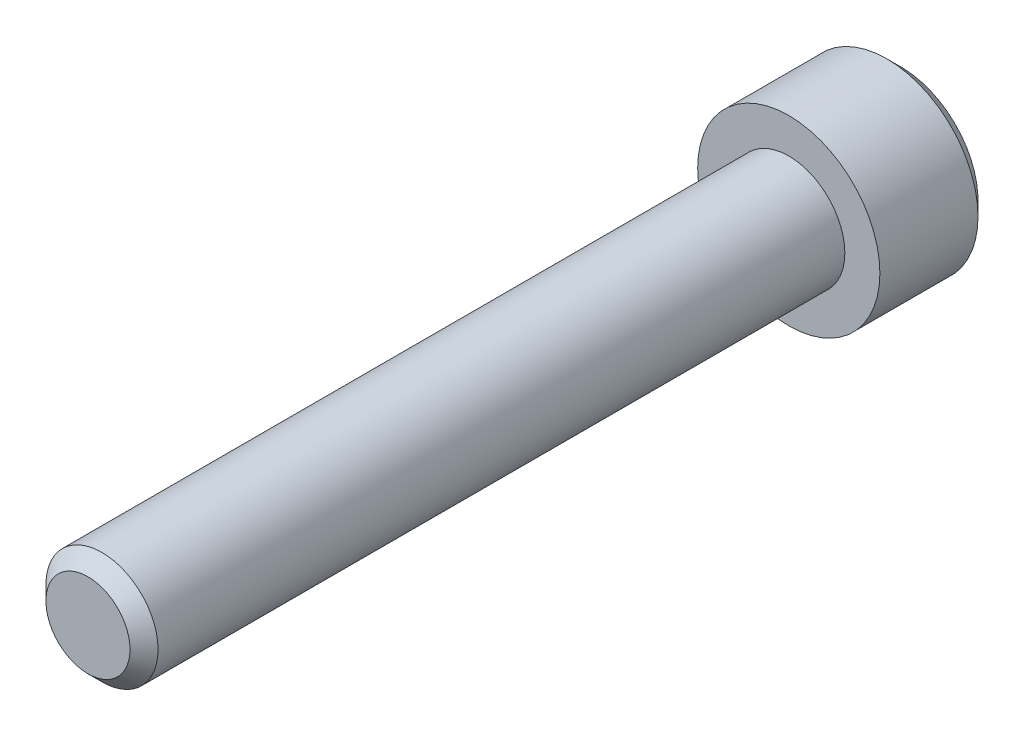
ISO-10303-21;
HEADER;
FILE_DESCRIPTION(('STEP AP214'),'2;1');
FILE_NAME('part.step','',(''),(''),'','','');
FILE_SCHEMA(('AUTOMOTIVE_DESIGN { 1 0 10303 214 1 1 1 1 }'));
ENDSEC;
DATA;
#1=APPLICATION_CONTEXT('core data for automotive mechanical design processes');
#2=APPLICATION_PROTOCOL_DEFINITION('international standard','automotive_design',2000,#1);
#3=PRODUCT_CONTEXT('',#1,'mechanical');
#4=PRODUCT('Part','Part','',(#3));
#5=PRODUCT_RELATED_PRODUCT_CATEGORY('part','',(#4));
#6=PRODUCT_DEFINITION_FORMATION('','',#4);
#7=PRODUCT_DEFINITION_CONTEXT('part definition',#1,'design');
#8=PRODUCT_DEFINITION('design','',#6,#7);
#9=PRODUCT_DEFINITION_SHAPE('','',#8);
#10=(LENGTH_UNIT() NAMED_UNIT(*) SI_UNIT(.MILLI.,.METRE.));
#11=(NAMED_UNIT(*) PLANE_ANGLE_UNIT() SI_UNIT($,.RADIAN.));
#12=(NAMED_UNIT(*) SI_UNIT($,.STERADIAN.) SOLID_ANGLE_UNIT());
#13=UNCERTAINTY_MEASURE_WITH_UNIT(LENGTH_MEASURE(1.E-05),#10,'distance_accuracy_value','');
#14=(GEOMETRIC_REPRESENTATION_CONTEXT(3) GLOBAL_UNCERTAINTY_ASSIGNED_CONTEXT((#13)) GLOBAL_UNIT_ASSIGNED_CONTEXT((#10,
#11,#12)) REPRESENTATION_CONTEXT('',''));
#15=CARTESIAN_POINT('',(0.,0.,0.));
#16=DIRECTION('',(0.,0.,1.));
#17=DIRECTION('',(1.,0.,0.));
#18=AXIS2_PLACEMENT_3D('',#15,#16,#17);
#19=CARTESIAN_POINT('',(-75.,72.8625,-92.));
#20=DIRECTION('',(0.,0.,-1.));
#21=DIRECTION('',(-1.,0.,0.));
#22=AXIS2_PLACEMENT_3D('',#19,#20,#21);
#23=PLANE('',#22);
#24=DIRECTION('',(-1.,0.,0.));
#25=VECTOR('',#24,1.);
#26=CARTESIAN_POINT('',(-73.2679491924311,69.8625,-92.));
#27=LINE('',#26,#25);
#28=CARTESIAN_POINT('',(-73.2679491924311,69.8625,-92.));
#29=VERTEX_POINT('',#28);
#30=CARTESIAN_POINT('',(-76.7320508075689,69.8625,-92.));
#31=VERTEX_POINT('',#30);
#32=EDGE_CURVE('E301',#29,#31,#27,.T.);
#33=ORIENTED_EDGE('',*,*,#32,.F.);
#34=DIRECTION('',(-0.5,-0.866025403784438,0.));
#35=VECTOR('',#34,1.);
#36=CARTESIAN_POINT('',(-71.5358983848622,72.8625,-92.));
#37=LINE('',#36,#35);
#38=CARTESIAN_POINT('',(-71.5358983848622,72.8625,-92.));
#39=VERTEX_POINT('',#38);
#40=EDGE_CURVE('E88',#39,#29,#37,.T.);
#41=ORIENTED_EDGE('',*,*,#40,.F.);
#42=DIRECTION('',(0.5,-0.866025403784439,0.));
#43=VECTOR('',#42,1.);
#44=CARTESIAN_POINT('',(-73.2679491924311,75.8625,-92.));
#45=LINE('',#44,#43);
#46=CARTESIAN_POINT('',(-73.2679491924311,75.8625,-92.));
#47=VERTEX_POINT('',#46);
#48=EDGE_CURVE('E31',#47,#39,#45,.T.);
#49=ORIENTED_EDGE('',*,*,#48,.F.);
#50=DIRECTION('',(1.,0.,0.));
#51=VECTOR('',#50,1.);
#52=CARTESIAN_POINT('',(-76.7320508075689,75.8625,-92.));
#53=LINE('',#52,#51);
#54=CARTESIAN_POINT('',(-76.7320508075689,75.8625,-92.));
#55=VERTEX_POINT('',#54);
#56=EDGE_CURVE('E66',#55,#47,#53,.T.);
#57=ORIENTED_EDGE('',*,*,#56,.F.);
#58=DIRECTION('',(0.5,0.866025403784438,0.));
#59=VECTOR('',#58,1.);
#60=CARTESIAN_POINT('',(-78.4641016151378,72.8625,-92.));
#61=LINE('',#60,#59);
#62=CARTESIAN_POINT('',(-78.4641016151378,72.8625,-92.));
#63=VERTEX_POINT('',#62);
#64=EDGE_CURVE('E76',#63,#55,#61,.T.);
#65=ORIENTED_EDGE('',*,*,#64,.F.);
#66=DIRECTION('',(-0.5,0.86602540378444,0.));
#67=VECTOR('',#66,1.);
#68=CARTESIAN_POINT('',(-76.7320508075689,69.8625,-92.));
#69=LINE('',#68,#67);
#70=EDGE_CURVE('E82',#31,#63,#69,.T.);
#71=ORIENTED_EDGE('',*,*,#70,.F.);
#72=EDGE_LOOP('',(#33,#41,#49,#57,#65,#71));
#73=FACE_BOUND('',#72,.T.);
#74=CARTESIAN_POINT('',(-75.,72.8625,-92.));
#75=DIRECTION('',(0.,0.,-1.));
#76=DIRECTION('',(-1.,0.,0.));
#77=AXIS2_PLACEMENT_3D('',#74,#75,#76);
#78=CIRCLE('',#77,5.5);
#79=CARTESIAN_POINT('',(-80.5,72.8625,-92.));
#80=VERTEX_POINT('',#79);
#81=EDGE_CURVE('E110',#80,#80,#78,.T.);
#82=ORIENTED_EDGE('',*,*,#81,.T.);
#83=EDGE_LOOP('',(#82));
#84=FACE_BOUND('',#83,.T.);
#85=ADVANCED_FACE('F16',(#73,#84),#23,.T.);
#86=CARTESIAN_POINT('',(-75.,72.8625,-84.));
#87=DIRECTION('',(0.,0.,1.));
#88=DIRECTION('',(1.,0.,0.));
#89=AXIS2_PLACEMENT_3D('',#86,#87,#88);
#90=PLANE('',#89);
#91=CARTESIAN_POINT('',(-75.,72.8625,-84.));
#92=DIRECTION('',(0.,0.,1.));
#93=DIRECTION('',(1.,0.,0.));
#94=AXIS2_PLACEMENT_3D('',#91,#92,#93);
#95=CIRCLE('',#94,4.);
#96=CARTESIAN_POINT('',(-71.,72.8625,-84.));
#97=VERTEX_POINT('',#96);
#98=EDGE_CURVE('E113',#97,#97,#95,.T.);
#99=ORIENTED_EDGE('',*,*,#98,.F.);
#100=EDGE_LOOP('',(#99));
#101=FACE_BOUND('',#100,.T.);
#102=CARTESIAN_POINT('',(-75.,72.8625,-84.));
#103=DIRECTION('',(0.,0.,-1.));
#104=DIRECTION('',(-1.,0.,0.));
#105=AXIS2_PLACEMENT_3D('',#102,#103,#104);
#106=CIRCLE('',#105,6.5);
#107=CARTESIAN_POINT('',(-81.5,72.8625,-84.));
#108=VERTEX_POINT('',#107);
#109=EDGE_CURVE('E102',#108,#108,#106,.T.);
#110=ORIENTED_EDGE('',*,*,#109,.F.);
#111=EDGE_LOOP('',(#110));
#112=FACE_BOUND('',#111,.T.);
#113=ADVANCED_FACE('F133',(#101,#112),#90,.T.);
#114=CARTESIAN_POINT('',(-75.,72.8625,-84.));
#115=DIRECTION('',(0.,0.,-1.));
#116=DIRECTION('',(-1.,0.,0.));
#117=AXIS2_PLACEMENT_3D('',#114,#115,#116);
#118=CYLINDRICAL_SURFACE('',#117,6.5);
#119=CARTESIAN_POINT('',(-75.,72.8625,-91.));
#120=DIRECTION('',(0.,0.,-1.));
#121=DIRECTION('',(-1.,0.,0.));
#122=AXIS2_PLACEMENT_3D('',#119,#120,#121);
#123=CIRCLE('',#122,6.5);
#124=CARTESIAN_POINT('',(-81.5,72.8625,-91.));
#125=VERTEX_POINT('',#124);
#126=EDGE_CURVE('E107',#125,#125,#123,.F.);
#127=ORIENTED_EDGE('',*,*,#126,.T.);
#128=EDGE_LOOP('',(#127));
#129=FACE_BOUND('',#128,.T.);
#130=ORIENTED_EDGE('',*,*,#109,.T.);
#131=EDGE_LOOP('',(#130));
#132=FACE_BOUND('',#131,.T.);
#133=ADVANCED_FACE('F138',(#129,#132),#118,.T.);
#134=CARTESIAN_POINT('',(-75.,72.8625,-91.));
#135=DIRECTION('',(0.,0.,1.));
#136=DIRECTION('',(1.,0.,0.));
#137=AXIS2_PLACEMENT_3D('',#134,#135,#136);
#138=CONICAL_SURFACE('',#137,6.5,0.785398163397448);
#139=ORIENTED_EDGE('',*,*,#81,.F.);
#140=EDGE_LOOP('',(#139));
#141=FACE_BOUND('',#140,.T.);
#142=ORIENTED_EDGE('',*,*,#126,.F.);
#143=EDGE_LOOP('',(#142));
#144=FACE_BOUND('',#143,.T.);
#145=ADVANCED_FACE('F144',(#141,#144),#138,.T.);
#146=CARTESIAN_POINT('',(-73.2679491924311,69.8625,-88.));
#147=DIRECTION('',(0.,-1.,0.));
#148=DIRECTION('',(1.,0.,0.));
#149=AXIS2_PLACEMENT_3D('',#146,#147,#148);
#150=PLANE('',#149);
#151=ORIENTED_EDGE('',*,*,#32,.T.);
#152=DIRECTION('',(0.,0.,-1.));
#153=VECTOR('',#152,1.);
#154=CARTESIAN_POINT('',(-76.7320508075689,69.8625,-88.));
#155=LINE('',#154,#153);
#156=CARTESIAN_POINT('',(-76.7320508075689,69.8625,-88.));
#157=VERTEX_POINT('',#156);
#158=EDGE_CURVE('E100',#157,#31,#155,.T.);
#159=ORIENTED_EDGE('',*,*,#158,.F.);
#160=DIRECTION('',(-1.,0.,0.));
#161=VECTOR('',#160,1.);
#162=CARTESIAN_POINT('',(-73.2679491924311,69.8625,-88.));
#163=LINE('',#162,#161);
#164=CARTESIAN_POINT('',(-73.2679491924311,69.8625,-88.));
#165=VERTEX_POINT('',#164);
#166=EDGE_CURVE('E94',#165,#157,#163,.T.);
#167=ORIENTED_EDGE('',*,*,#166,.F.);
#168=DIRECTION('',(0.,0.,-1.));
#169=VECTOR('',#168,1.);
#170=CARTESIAN_POINT('',(-73.2679491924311,69.8625,-88.));
#171=LINE('',#170,#169);
#172=EDGE_CURVE('E97',#165,#29,#171,.T.);
#173=ORIENTED_EDGE('',*,*,#172,.T.);
#174=EDGE_LOOP('',(#151,#159,#167,#173));
#175=FACE_BOUND('',#174,.T.);
#176=ADVANCED_FACE('F147',(#175),#150,.F.);
#177=CARTESIAN_POINT('',(-76.7320508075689,69.8625,-88.));
#178=DIRECTION('',(-0.86602540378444,-0.5,0.));
#179=DIRECTION('',(0.5,-0.86602540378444,0.));
#180=AXIS2_PLACEMENT_3D('',#177,#178,#179);
#181=PLANE('',#180);
#182=ORIENTED_EDGE('',*,*,#70,.T.);
#183=DIRECTION('',(0.,0.,-1.));
#184=VECTOR('',#183,1.);
#185=CARTESIAN_POINT('',(-78.4641016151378,72.8625,-88.));
#186=LINE('',#185,#184);
#187=CARTESIAN_POINT('',(-78.4641016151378,72.8625,-88.));
#188=VERTEX_POINT('',#187);
#189=EDGE_CURVE('E72',#188,#63,#186,.T.);
#190=ORIENTED_EDGE('',*,*,#189,.F.);
#191=DIRECTION('',(-0.5,0.86602540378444,0.));
#192=VECTOR('',#191,1.);
#193=CARTESIAN_POINT('',(-76.7320508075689,69.8625,-88.));
#194=LINE('',#193,#192);
#195=EDGE_CURVE('E298',#157,#188,#194,.T.);
#196=ORIENTED_EDGE('',*,*,#195,.F.);
#197=ORIENTED_EDGE('',*,*,#158,.T.);
#198=EDGE_LOOP('',(#182,#190,#196,#197));
#199=FACE_BOUND('',#198,.T.);
#200=ADVANCED_FACE('F152',(#199),#181,.F.);
#201=CARTESIAN_POINT('',(-78.4641016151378,72.8625,-88.));
#202=DIRECTION('',(-0.866025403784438,0.5,0.));
#203=DIRECTION('',(-0.5,-0.866025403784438,0.));
#204=AXIS2_PLACEMENT_3D('',#201,#202,#203);
#205=PLANE('',#204);
#206=ORIENTED_EDGE('',*,*,#64,.T.);
#207=DIRECTION('',(0.,0.,-1.));
#208=VECTOR('',#207,1.);
#209=CARTESIAN_POINT('',(-76.7320508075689,75.8625,-88.));
#210=LINE('',#209,#208);
#211=CARTESIAN_POINT('',(-76.7320508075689,75.8625,-88.));
#212=VERTEX_POINT('',#211);
#213=EDGE_CURVE('E61',#212,#55,#210,.T.);
#214=ORIENTED_EDGE('',*,*,#213,.F.);
#215=DIRECTION('',(0.5,0.866025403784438,0.));
#216=VECTOR('',#215,1.);
#217=CARTESIAN_POINT('',(-78.4641016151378,72.8625,-88.));
#218=LINE('',#217,#216);
#219=EDGE_CURVE('E304',#188,#212,#218,.T.);
#220=ORIENTED_EDGE('',*,*,#219,.F.);
#221=ORIENTED_EDGE('',*,*,#189,.T.);
#222=EDGE_LOOP('',(#206,#214,#220,#221));
#223=FACE_BOUND('',#222,.T.);
#224=ADVANCED_FACE('F77',(#223),#205,.F.);
#225=CARTESIAN_POINT('',(-76.7320508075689,75.8625,-88.));
#226=DIRECTION('',(0.,1.,0.));
#227=DIRECTION('',(-1.,0.,0.));
#228=AXIS2_PLACEMENT_3D('',#225,#226,#227);
#229=PLANE('',#228);
#230=ORIENTED_EDGE('',*,*,#56,.T.);
#231=DIRECTION('',(0.,0.,-1.));
#232=VECTOR('',#231,1.);
#233=CARTESIAN_POINT('',(-73.2679491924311,75.8625,-88.));
#234=LINE('',#233,#232);
#235=CARTESIAN_POINT('',(-73.2679491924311,75.8625,-88.));
#236=VERTEX_POINT('',#235);
#237=EDGE_CURVE('E73',#236,#47,#234,.T.);
#238=ORIENTED_EDGE('',*,*,#237,.F.);
#239=DIRECTION('',(1.,0.,0.));
#240=VECTOR('',#239,1.);
#241=CARTESIAN_POINT('',(-76.7320508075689,75.8625,-88.));
#242=LINE('',#241,#240);
#243=EDGE_CURVE('E69',#212,#236,#242,.T.);
#244=ORIENTED_EDGE('',*,*,#243,.F.);
#245=ORIENTED_EDGE('',*,*,#213,.T.);
#246=EDGE_LOOP('',(#230,#238,#244,#245));
#247=FACE_BOUND('',#246,.T.);
#248=ADVANCED_FACE('F63',(#247),#229,.F.);
#249=CARTESIAN_POINT('',(-73.2679491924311,75.8625,-88.));
#250=DIRECTION('',(0.866025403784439,0.5,0.));
#251=DIRECTION('',(-0.5,0.866025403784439,0.));
#252=AXIS2_PLACEMENT_3D('',#249,#250,#251);
#253=PLANE('',#252);
#254=ORIENTED_EDGE('',*,*,#48,.T.);
#255=DIRECTION('',(0.,0.,-1.));
#256=VECTOR('',#255,1.);
#257=CARTESIAN_POINT('',(-71.5358983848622,72.8625,-88.));
#258=LINE('',#257,#256);
#259=CARTESIAN_POINT('',(-71.5358983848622,72.8625,-88.));
#260=VERTEX_POINT('',#259);
#261=EDGE_CURVE('E95',#260,#39,#258,.T.);
#262=ORIENTED_EDGE('',*,*,#261,.F.);
#263=DIRECTION('',(0.5,-0.866025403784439,0.));
#264=VECTOR('',#263,1.);
#265=CARTESIAN_POINT('',(-73.2679491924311,75.8625,-88.));
#266=LINE('',#265,#264);
#267=EDGE_CURVE('E40',#236,#260,#266,.T.);
#268=ORIENTED_EDGE('',*,*,#267,.F.);
#269=ORIENTED_EDGE('',*,*,#237,.T.);
#270=EDGE_LOOP('',(#254,#262,#268,#269));
#271=FACE_BOUND('',#270,.T.);
#272=ADVANCED_FACE('F171',(#271),#253,.F.);
#273=CARTESIAN_POINT('',(-71.5358983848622,72.8625,-88.));
#274=DIRECTION('',(0.866025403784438,-0.5,0.));
#275=DIRECTION('',(0.5,0.866025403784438,0.));
#276=AXIS2_PLACEMENT_3D('',#273,#274,#275);
#277=PLANE('',#276);
#278=ORIENTED_EDGE('',*,*,#40,.T.);
#279=ORIENTED_EDGE('',*,*,#172,.F.);
#280=DIRECTION('',(-0.5,-0.866025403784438,0.));
#281=VECTOR('',#280,1.);
#282=CARTESIAN_POINT('',(-71.5358983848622,72.8625,-88.));
#283=LINE('',#282,#281);
#284=EDGE_CURVE('E104',#260,#165,#283,.T.);
#285=ORIENTED_EDGE('',*,*,#284,.F.);
#286=ORIENTED_EDGE('',*,*,#261,.T.);
#287=EDGE_LOOP('',(#278,#279,#285,#286));
#288=FACE_BOUND('',#287,.T.);
#289=ADVANCED_FACE('F174',(#288),#277,.F.);
#290=CARTESIAN_POINT('',(-73.2679491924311,69.8625,-88.));
#291=DIRECTION('',(0.,-0.5,0.866025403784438));
#292=DIRECTION('',(0.,-0.866025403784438,-0.5));
#293=AXIS2_PLACEMENT_3D('',#290,#291,#292);
#294=PLANE('',#293);
#295=ORIENTED_EDGE('',*,*,#166,.T.);
#296=DIRECTION('',(-0.44721359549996,-0.774596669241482,-0.447213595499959));
#297=VECTOR('',#296,1.);
#298=CARTESIAN_POINT('',(-76.0392304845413,71.0625,-87.3071796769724));
#299=LINE('',#298,#297);
#300=CARTESIAN_POINT('',(-75.,72.8625,-86.2679491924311));
#301=VERTEX_POINT('',#300);
#302=EDGE_CURVE('E291',#301,#157,#299,.T.);
#303=ORIENTED_EDGE('',*,*,#302,.F.);
#304=DIRECTION('',(0.447213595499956,-0.774596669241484,-0.447213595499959));
#305=VECTOR('',#304,1.);
#306=CARTESIAN_POINT('',(-73.9607695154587,71.0625,-87.3071796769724));
#307=LINE('',#306,#305);
#308=EDGE_CURVE('E294',#301,#165,#307,.T.);
#309=ORIENTED_EDGE('',*,*,#308,.T.);
#310=EDGE_LOOP('',(#295,#303,#309));
#311=FACE_BOUND('',#310,.T.);
#312=ADVANCED_FACE('F177',(#311),#294,.F.);
#313=CARTESIAN_POINT('',(-76.7320508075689,69.8625,-88.));
#314=DIRECTION('',(-0.433012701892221,-0.25,0.866025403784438));
#315=DIRECTION('',(0.894427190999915,0.,0.447213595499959));
#316=AXIS2_PLACEMENT_3D('',#313,#314,#315);
#317=PLANE('',#316);
#318=ORIENTED_EDGE('',*,*,#195,.T.);
#319=DIRECTION('',(-0.894427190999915,0.,-0.447213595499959));
#320=VECTOR('',#319,1.);
#321=CARTESIAN_POINT('',(-77.0784609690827,72.8625,-87.3071796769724));
#322=LINE('',#321,#320);
#323=EDGE_CURVE('E324',#301,#188,#322,.T.);
#324=ORIENTED_EDGE('',*,*,#323,.F.);
#325=ORIENTED_EDGE('',*,*,#302,.T.);
#326=EDGE_LOOP('',(#318,#324,#325));
#327=FACE_BOUND('',#326,.T.);
#328=ADVANCED_FACE('F193',(#327),#317,.F.);
#329=CARTESIAN_POINT('',(-78.4641016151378,72.8625,-88.));
#330=DIRECTION('',(-0.43301270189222,0.25,0.866025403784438));
#331=DIRECTION('',(0.894427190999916,0.,0.447213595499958));
#332=AXIS2_PLACEMENT_3D('',#329,#330,#331);
#333=PLANE('',#332);
#334=ORIENTED_EDGE('',*,*,#219,.T.);
#335=DIRECTION('',(-0.447213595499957,0.774596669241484,-0.447213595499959));
#336=VECTOR('',#335,1.);
#337=CARTESIAN_POINT('',(-76.0392304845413,74.6625,-87.3071796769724));
#338=LINE('',#337,#336);
#339=EDGE_CURVE('E325',#301,#212,#338,.T.);
#340=ORIENTED_EDGE('',*,*,#339,.F.);
#341=ORIENTED_EDGE('',*,*,#323,.T.);
#342=EDGE_LOOP('',(#334,#340,#341));
#343=FACE_BOUND('',#342,.T.);
#344=ADVANCED_FACE('F189',(#343),#333,.F.);
#345=CARTESIAN_POINT('',(-76.7320508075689,75.8625,-88.));
#346=DIRECTION('',(0.,0.5,0.866025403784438));
#347=DIRECTION('',(0.,-0.866025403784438,0.5));
#348=AXIS2_PLACEMENT_3D('',#345,#346,#347);
#349=PLANE('',#348);
#350=ORIENTED_EDGE('',*,*,#243,.T.);
#351=DIRECTION('',(0.447213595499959,0.774596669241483,-0.447213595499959));
#352=VECTOR('',#351,1.);
#353=CARTESIAN_POINT('',(-73.9607695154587,74.6625,-87.3071796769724));
#354=LINE('',#353,#352);
#355=EDGE_CURVE('E318',#301,#236,#354,.T.);
#356=ORIENTED_EDGE('',*,*,#355,.F.);
#357=ORIENTED_EDGE('',*,*,#339,.T.);
#358=EDGE_LOOP('',(#350,#356,#357));
#359=FACE_BOUND('',#358,.T.);
#360=ADVANCED_FACE('F186',(#359),#349,.F.);
#361=CARTESIAN_POINT('',(-73.2679491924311,75.8625,-88.));
#362=DIRECTION('',(0.43301270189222,0.25,0.866025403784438));
#363=DIRECTION('',(0.894427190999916,0.,-0.447213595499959));
#364=AXIS2_PLACEMENT_3D('',#361,#362,#363);
#365=PLANE('',#364);
#366=ORIENTED_EDGE('',*,*,#267,.T.);
#367=DIRECTION('',(0.894427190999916,0.,-0.447213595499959));
#368=VECTOR('',#367,1.);
#369=CARTESIAN_POINT('',(-72.9215390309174,72.8625,-87.3071796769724));
#370=LINE('',#369,#368);
#371=EDGE_CURVE('E331',#301,#260,#370,.T.);
#372=ORIENTED_EDGE('',*,*,#371,.F.);
#373=ORIENTED_EDGE('',*,*,#355,.T.);
#374=EDGE_LOOP('',(#366,#372,#373));
#375=FACE_BOUND('',#374,.T.);
#376=ADVANCED_FACE('F182',(#375),#365,.F.);
#377=CARTESIAN_POINT('',(-71.5358983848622,72.8625,-88.));
#378=DIRECTION('',(0.43301270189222,-0.25,0.866025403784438));
#379=DIRECTION('',(0.894427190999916,0.,-0.447213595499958));
#380=AXIS2_PLACEMENT_3D('',#377,#378,#379);
#381=PLANE('',#380);
#382=ORIENTED_EDGE('',*,*,#284,.T.);
#383=ORIENTED_EDGE('',*,*,#308,.F.);
#384=ORIENTED_EDGE('',*,*,#371,.T.);
#385=EDGE_LOOP('',(#382,#383,#384));
#386=FACE_BOUND('',#385,.T.);
#387=ADVANCED_FACE('F179',(#386),#381,.F.);
#388=CARTESIAN_POINT('',(-75.,72.8625,-64.));
#389=DIRECTION('',(0.,0.,-1.));
#390=DIRECTION('',(-1.,0.,0.));
#391=AXIS2_PLACEMENT_3D('',#388,#389,#390);
#392=CYLINDRICAL_SURFACE('',#391,4.);
#393=CARTESIAN_POINT('',(-75.,72.8625,-35.));
#394=DIRECTION('',(0.,0.,1.));
#395=DIRECTION('',(1.,0.,0.));
#396=AXIS2_PLACEMENT_3D('',#393,#394,#395);
#397=CIRCLE('',#396,4.);
#398=CARTESIAN_POINT('',(-71.,72.8625,-35.));
#399=VERTEX_POINT('',#398);
#400=EDGE_CURVE('E20',#399,#399,#397,.F.);
#401=ORIENTED_EDGE('',*,*,#400,.T.);
#402=EDGE_LOOP('',(#401));
#403=FACE_BOUND('',#402,.T.);
#404=ORIENTED_EDGE('',*,*,#98,.T.);
#405=EDGE_LOOP('',(#404));
#406=FACE_BOUND('',#405,.T.);
#407=ADVANCED_FACE('F120',(#403,#406),#392,.T.);
#408=CARTESIAN_POINT('',(-75.,72.8625,-34.));
#409=DIRECTION('',(0.,0.,1.));
#410=DIRECTION('',(1.,0.,0.));
#411=AXIS2_PLACEMENT_3D('',#408,#409,#410);
#412=PLANE('',#411);
#413=CARTESIAN_POINT('',(-75.,72.8625,-34.));
#414=DIRECTION('',(0.,0.,1.));
#415=DIRECTION('',(1.,0.,0.));
#416=AXIS2_PLACEMENT_3D('',#413,#414,#415);
#417=CIRCLE('',#416,3.);
#418=CARTESIAN_POINT('',(-72.,72.8625,-34.));
#419=VERTEX_POINT('',#418);
#420=EDGE_CURVE('E11',#419,#419,#417,.T.);
#421=ORIENTED_EDGE('',*,*,#420,.T.);
#422=EDGE_LOOP('',(#421));
#423=FACE_BOUND('',#422,.T.);
#424=ADVANCED_FACE('F18',(#423),#412,.T.);
#425=CARTESIAN_POINT('',(-75.,72.8625,-35.));
#426=DIRECTION('',(0.,0.,-1.));
#427=DIRECTION('',(-1.,0.,0.));
#428=AXIS2_PLACEMENT_3D('',#425,#426,#427);
#429=CONICAL_SURFACE('',#428,4.,0.785398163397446);
#430=ORIENTED_EDGE('',*,*,#420,.F.);
#431=EDGE_LOOP('',(#430));
#432=FACE_BOUND('',#431,.T.);
#433=ORIENTED_EDGE('',*,*,#400,.F.);
#434=EDGE_LOOP('',(#433));
#435=FACE_BOUND('',#434,.T.);
#436=ADVANCED_FACE('F122',(#432,#435),#429,.T.);
#437=CLOSED_SHELL('',(#85,#113,#133,#145,#176,#200,#224,#248,#272,#289,#312,#328,#344,#360,#376,
#387,#407,#424,#436));
#438=MANIFOLD_SOLID_BREP('B1',#437);
#439=ADVANCED_BREP_SHAPE_REPRESENTATION('',(#18,#438),#14);
#440=SHAPE_DEFINITION_REPRESENTATION(#9,#439);
ENDSEC;
END-ISO-10303-21;
